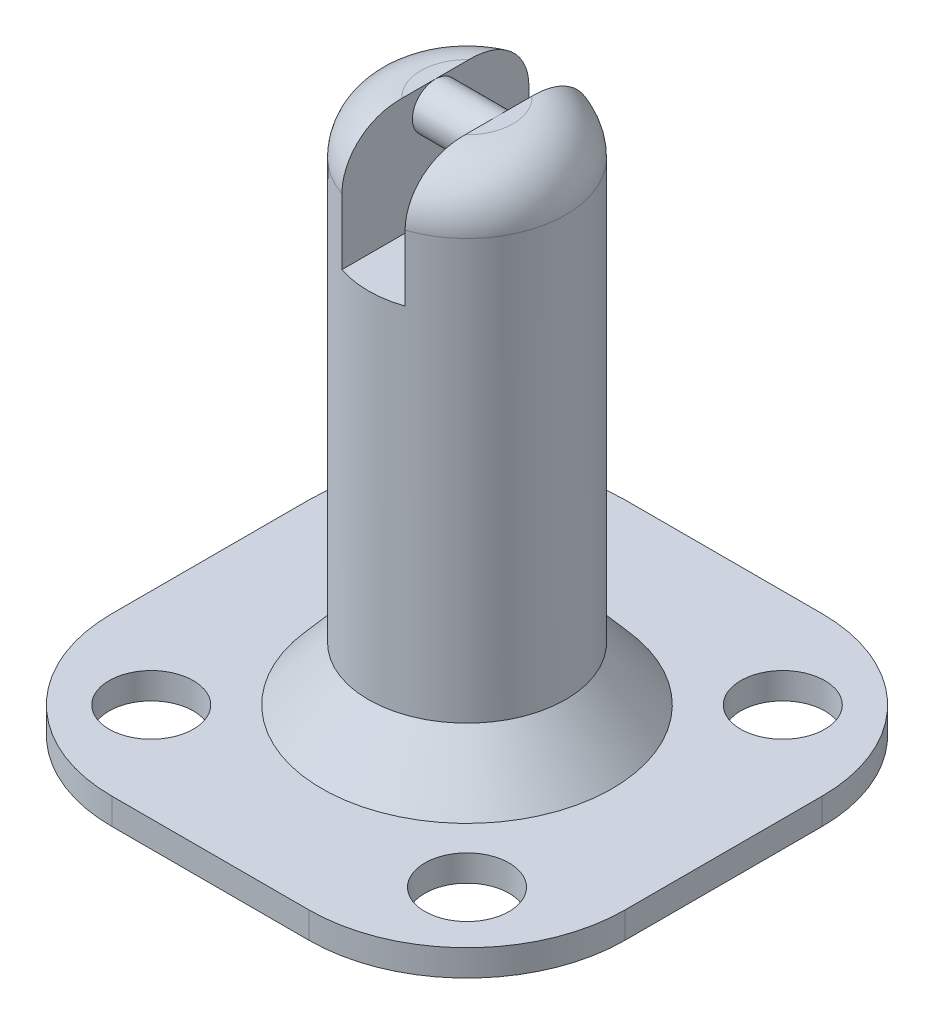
ISO-10303-21;
HEADER;
FILE_DESCRIPTION(('STEP AP214'),'2;1');
FILE_NAME('part.step','',(''),(''),'','','');
FILE_SCHEMA(('AUTOMOTIVE_DESIGN { 1 0 10303 214 1 1 1 1 }'));
ENDSEC;
DATA;
#1=APPLICATION_CONTEXT('core data for automotive mechanical design processes');
#2=APPLICATION_PROTOCOL_DEFINITION('international standard','automotive_design',2000,#1);
#3=PRODUCT_CONTEXT('',#1,'mechanical');
#4=PRODUCT('Part','Part','',(#3));
#5=PRODUCT_RELATED_PRODUCT_CATEGORY('part','',(#4));
#6=PRODUCT_DEFINITION_FORMATION('','',#4);
#7=PRODUCT_DEFINITION_CONTEXT('part definition',#1,'design');
#8=PRODUCT_DEFINITION('design','',#6,#7);
#9=PRODUCT_DEFINITION_SHAPE('','',#8);
#10=(LENGTH_UNIT() NAMED_UNIT(*) SI_UNIT(.MILLI.,.METRE.));
#11=(NAMED_UNIT(*) PLANE_ANGLE_UNIT() SI_UNIT($,.RADIAN.));
#12=(NAMED_UNIT(*) SI_UNIT($,.STERADIAN.) SOLID_ANGLE_UNIT());
#13=UNCERTAINTY_MEASURE_WITH_UNIT(LENGTH_MEASURE(1.E-05),#10,'distance_accuracy_value','');
#14=(GEOMETRIC_REPRESENTATION_CONTEXT(3) GLOBAL_UNCERTAINTY_ASSIGNED_CONTEXT((#13)) GLOBAL_UNIT_ASSIGNED_CONTEXT((#10,
#11,#12)) REPRESENTATION_CONTEXT('',''));
#15=CARTESIAN_POINT('',(0.,0.,0.));
#16=DIRECTION('',(0.,0.,1.));
#17=DIRECTION('',(1.,0.,0.));
#18=AXIS2_PLACEMENT_3D('',#15,#16,#17);
#19=CARTESIAN_POINT('',(0.,20.,0.));
#20=DIRECTION('',(0.,1.,0.));
#21=DIRECTION('',(0.,0.,1.));
#22=AXIS2_PLACEMENT_3D('',#19,#20,#21);
#23=PLANE('',#22);
#24=DIRECTION('',(0.,0.,-1.));
#25=VECTOR('',#24,1.);
#26=CARTESIAN_POINT('',(-1.2,20.,0.));
#27=LINE('',#26,#25);
#28=CARTESIAN_POINT('',(-1.2,20.,1.2737739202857));
#29=VERTEX_POINT('',#28);
#30=CARTESIAN_POINT('',(-1.2,20.,-1.2737739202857));
#31=VERTEX_POINT('',#30);
#32=EDGE_CURVE('E176',#29,#31,#27,.T.);
#33=ORIENTED_EDGE('',*,*,#32,.T.);
#34=CARTESIAN_POINT('',(0.,20.,0.));
#35=DIRECTION('',(0.,1.,0.));
#36=DIRECTION('',(0.,0.,1.));
#37=AXIS2_PLACEMENT_3D('',#34,#35,#36);
#38=CIRCLE('',#37,1.75);
#39=EDGE_CURVE('E147',#31,#29,#38,.T.);
#40=ORIENTED_EDGE('',*,*,#39,.T.);
#41=EDGE_LOOP('',(#33,#40));
#42=FACE_BOUND('',#41,.T.);
#43=ADVANCED_FACE('F33',(#42),#23,.T.);
#44=CARTESIAN_POINT('',(0.,20.,0.));
#45=DIRECTION('',(0.,-1.,0.));
#46=DIRECTION('',(0.,0.,-1.));
#47=AXIS2_PLACEMENT_3D('',#44,#45,#46);
#48=CYLINDRICAL_SURFACE('',#47,3.75);
#49=CARTESIAN_POINT('',(0.,2.04841628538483,0.));
#50=DIRECTION('',(0.,1.,0.));
#51=DIRECTION('',(0.,0.,1.));
#52=AXIS2_PLACEMENT_3D('',#49,#50,#51);
#53=CIRCLE('',#52,3.75);
#54=CARTESIAN_POINT('',(0.,2.04841628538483,3.75));
#55=VERTEX_POINT('',#54);
#56=EDGE_CURVE('E168',#55,#55,#53,.T.);
#57=ORIENTED_EDGE('',*,*,#56,.T.);
#58=EDGE_LOOP('',(#57));
#59=FACE_BOUND('',#58,.T.);
#60=DIRECTION('',(0.,-1.,0.));
#61=VECTOR('',#60,1.);
#62=CARTESIAN_POINT('',(-1.2,20.,3.5528157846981));
#63=LINE('',#62,#61);
#64=CARTESIAN_POINT('',(-1.2,18.,3.5528157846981));
#65=VERTEX_POINT('',#64);
#66=CARTESIAN_POINT('',(-1.2,15.5,3.5528157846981));
#67=VERTEX_POINT('',#66);
#68=EDGE_CURVE('E158',#65,#67,#63,.T.);
#69=ORIENTED_EDGE('',*,*,#68,.F.);
#70=CARTESIAN_POINT('',(0.,18.,0.));
#71=DIRECTION('',(0.,1.,0.));
#72=DIRECTION('',(0.,0.,1.));
#73=AXIS2_PLACEMENT_3D('',#70,#71,#72);
#74=CIRCLE('',#73,3.75);
#75=CARTESIAN_POINT('',(-1.2,18.,-3.5528157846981));
#76=VERTEX_POINT('',#75);
#77=EDGE_CURVE('E254',#65,#76,#74,.F.);
#78=ORIENTED_EDGE('',*,*,#77,.T.);
#79=DIRECTION('',(0.,-1.,0.));
#80=VECTOR('',#79,1.);
#81=CARTESIAN_POINT('',(-1.2,20.,-3.5528157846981));
#82=LINE('',#81,#80);
#83=CARTESIAN_POINT('',(-1.2,15.5,-3.5528157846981));
#84=VERTEX_POINT('',#83);
#85=EDGE_CURVE('E142',#84,#76,#82,.F.);
#86=ORIENTED_EDGE('',*,*,#85,.F.);
#87=CARTESIAN_POINT('',(0.,15.5,0.));
#88=DIRECTION('',(0.,-1.,0.));
#89=DIRECTION('',(0.,0.,-1.));
#90=AXIS2_PLACEMENT_3D('',#87,#88,#89);
#91=CIRCLE('',#90,3.75);
#92=CARTESIAN_POINT('',(1.2,15.5,-3.5528157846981));
#93=VERTEX_POINT('',#92);
#94=EDGE_CURVE('E135',#84,#93,#91,.T.);
#95=ORIENTED_EDGE('',*,*,#94,.T.);
#96=DIRECTION('',(0.,-1.,0.));
#97=VECTOR('',#96,1.);
#98=CARTESIAN_POINT('',(1.2,20.,-3.5528157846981));
#99=LINE('',#98,#97);
#100=CARTESIAN_POINT('',(1.2,18.,-3.5528157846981));
#101=VERTEX_POINT('',#100);
#102=EDGE_CURVE('E139',#93,#101,#99,.F.);
#103=ORIENTED_EDGE('',*,*,#102,.T.);
#104=CARTESIAN_POINT('',(0.,18.,0.));
#105=DIRECTION('',(0.,1.,0.));
#106=DIRECTION('',(0.,0.,1.));
#107=AXIS2_PLACEMENT_3D('',#104,#105,#106);
#108=CIRCLE('',#107,3.75);
#109=CARTESIAN_POINT('',(1.2,18.,3.5528157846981));
#110=VERTEX_POINT('',#109);
#111=EDGE_CURVE('E255',#101,#110,#108,.F.);
#112=ORIENTED_EDGE('',*,*,#111,.T.);
#113=DIRECTION('',(0.,-1.,0.));
#114=VECTOR('',#113,1.);
#115=CARTESIAN_POINT('',(1.2,20.,3.5528157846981));
#116=LINE('',#115,#114);
#117=CARTESIAN_POINT('',(1.2,15.5,3.5528157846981));
#118=VERTEX_POINT('',#117);
#119=EDGE_CURVE('E157',#110,#118,#116,.T.);
#120=ORIENTED_EDGE('',*,*,#119,.T.);
#121=EDGE_CURVE('E148',#118,#67,#91,.T.);
#122=ORIENTED_EDGE('',*,*,#121,.T.);
#123=EDGE_LOOP('',(#69,#78,#86,#95,#103,#112,#120,#122));
#124=FACE_BOUND('',#123,.T.);
#125=ADVANCED_FACE('F138',(#59,#124),#48,.T.);
#126=DIRECTION('',(0.,0.,-1.));
#127=VECTOR('',#126,1.);
#128=CARTESIAN_POINT('',(1.2,20.,0.));
#129=LINE('',#128,#127);
#130=CARTESIAN_POINT('',(1.2,20.,1.2737739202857));
#131=VERTEX_POINT('',#130);
#132=CARTESIAN_POINT('',(1.2,20.,-1.2737739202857));
#133=VERTEX_POINT('',#132);
#134=EDGE_CURVE('E179',#131,#133,#129,.T.);
#135=ORIENTED_EDGE('',*,*,#134,.F.);
#136=CARTESIAN_POINT('',(0.,20.,0.));
#137=DIRECTION('',(0.,1.,0.));
#138=DIRECTION('',(0.,0.,1.));
#139=AXIS2_PLACEMENT_3D('',#136,#137,#138);
#140=CIRCLE('',#139,1.75);
#141=EDGE_CURVE('E256',#131,#133,#140,.T.);
#142=ORIENTED_EDGE('',*,*,#141,.T.);
#143=EDGE_LOOP('',(#135,#142));
#144=FACE_BOUND('',#143,.T.);
#145=ADVANCED_FACE('F234',(#144),#23,.T.);
#146=CARTESIAN_POINT('',(1.2,0.,0.));
#147=DIRECTION('',(1.,0.,0.));
#148=DIRECTION('',(0.,0.,-1.));
#149=AXIS2_PLACEMENT_3D('',#146,#147,#148);
#150=PLANE('',#149);
#151=CARTESIAN_POINT('',(1.2,19.12,0.));
#152=DIRECTION('',(1.,0.,0.));
#153=DIRECTION('',(0.,0.,-1.));
#154=AXIS2_PLACEMENT_3D('',#151,#152,#153);
#155=CIRCLE('',#154,0.875000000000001);
#156=CARTESIAN_POINT('',(1.2,19.12,-0.875000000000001));
#157=VERTEX_POINT('',#156);
#158=EDGE_CURVE('E181',#157,#157,#155,.F.);
#159=ORIENTED_EDGE('',*,*,#158,.F.);
#160=EDGE_LOOP('',(#159));
#161=FACE_BOUND('',#160,.T.);
#162=ORIENTED_EDGE('',*,*,#134,.T.);
#163=CARTESIAN_POINT('',(1.2,20.,-1.2737739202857));
#164=CARTESIAN_POINT('',(1.2,20.0000430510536,-1.34749856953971));
#165=CARTESIAN_POINT('',(1.2,19.9978387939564,-1.42128173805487));
#166=CARTESIAN_POINT('',(1.2,19.9881911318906,-1.56864509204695));
#167=CARTESIAN_POINT('',(1.2,19.9807371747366,-1.64222456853));
#168=CARTESIAN_POINT('',(1.2,19.959785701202,-1.78893589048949));
#169=CARTESIAN_POINT('',(1.2,19.9462572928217,-1.86206348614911));
#170=CARTESIAN_POINT('',(1.2,19.9127167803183,-2.0067464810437));
#171=CARTESIAN_POINT('',(1.2,19.8927100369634,-2.07830312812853));
#172=CARTESIAN_POINT('',(1.2,19.831526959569,-2.26246423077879));
#173=CARTESIAN_POINT('',(1.2,19.7848925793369,-2.37332835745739));
#174=CARTESIAN_POINT('',(1.2,19.6739503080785,-2.58549931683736));
#175=CARTESIAN_POINT('',(1.2,19.6096885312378,-2.68683017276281));
#176=CARTESIAN_POINT('',(1.2,19.464141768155,-2.87723205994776));
#177=CARTESIAN_POINT('',(1.2,19.3827810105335,-2.96624549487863));
#178=CARTESIAN_POINT('',(1.2,19.2052034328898,-3.12819040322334));
#179=CARTESIAN_POINT('',(1.2,19.1089752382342,-3.20110945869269));
#180=CARTESIAN_POINT('',(1.2,18.9116433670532,-3.3236154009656));
#181=CARTESIAN_POINT('',(1.2,18.8113100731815,-3.37444711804));
#182=CARTESIAN_POINT('',(1.2,18.6033679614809,-3.45776034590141));
#183=CARTESIAN_POINT('',(1.2,18.4957686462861,-3.49026532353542));
#184=CARTESIAN_POINT('',(1.2,18.3227167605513,-3.52626989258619));
#185=CARTESIAN_POINT('',(1.2,18.2585386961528,-3.53621771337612));
#186=CARTESIAN_POINT('',(1.2,18.1295846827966,-3.54948893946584));
#187=CARTESIAN_POINT('',(1.2,18.0648096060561,-3.55282082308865));
#188=CARTESIAN_POINT('',(1.2,18.,-3.5528157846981));
#189=B_SPLINE_CURVE_WITH_KNOTS('',3,(#163,#164,#165,#166,#167,#168,#169,#170,#171,#172,#173,
#174,#175,#176,#177,#178,#179,#180,#181,#182,#183,#184,#185,#186,#187,#188),.UNSPECIFIED.,.F.,
.F.,(4,2,2,2,2,2,2,2,2,2,2,2,4),(0.,0.221225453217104,0.442896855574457,0.665708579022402,
0.888336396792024,1.24750116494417,1.6057351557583,1.96559140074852,2.32572433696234,
2.66149094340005,2.99682662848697,3.19135178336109,3.38562749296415),.UNSPECIFIED.);
#190=EDGE_CURVE('E156',#133,#101,#189,.T.);
#191=ORIENTED_EDGE('',*,*,#190,.T.);
#192=ORIENTED_EDGE('',*,*,#102,.F.);
#193=DIRECTION('',(0.,0.,1.));
#194=VECTOR('',#193,1.);
#195=CARTESIAN_POINT('',(1.2,15.5,-3.75));
#196=LINE('',#195,#194);
#197=EDGE_CURVE('E155',#93,#118,#196,.T.);
#198=ORIENTED_EDGE('',*,*,#197,.T.);
#199=ORIENTED_EDGE('',*,*,#119,.F.);
#200=CARTESIAN_POINT('',(1.2,18.,3.5528157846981));
#201=CARTESIAN_POINT('',(1.2,18.053746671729,3.55281611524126));
#202=CARTESIAN_POINT('',(1.2,18.1074672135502,3.5505275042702));
#203=CARTESIAN_POINT('',(1.2,18.2145152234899,3.54140215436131));
#204=CARTESIAN_POINT('',(1.2,18.2678427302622,3.53456586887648));
#205=CARTESIAN_POINT('',(1.2,18.4264589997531,3.5073278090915));
#206=CARTESIAN_POINT('',(1.2,18.5306708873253,3.48019645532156));
#207=CARTESIAN_POINT('',(1.2,18.7330305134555,3.408853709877));
#208=CARTESIAN_POINT('',(1.2,18.8311768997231,3.36463852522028));
#209=CARTESIAN_POINT('',(1.2,19.0188029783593,3.26053979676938));
#210=CARTESIAN_POINT('',(1.2,19.1082806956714,3.20065269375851));
#211=CARTESIAN_POINT('',(1.2,19.2773175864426,3.0662588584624));
#212=CARTESIAN_POINT('',(1.2,19.356737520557,2.99157736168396));
#213=CARTESIAN_POINT('',(1.2,19.502463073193,2.83046505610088));
#214=CARTESIAN_POINT('',(1.2,19.5687749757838,2.74403991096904));
#215=CARTESIAN_POINT('',(1.2,19.6896442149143,2.5581494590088));
#216=CARTESIAN_POINT('',(1.2,19.7435916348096,2.45828916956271));
#217=CARTESIAN_POINT('',(1.2,19.8356250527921,2.25128145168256));
#218=CARTESIAN_POINT('',(1.2,19.8736761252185,2.14411857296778));
#219=CARTESIAN_POINT('',(1.2,19.9211143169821,1.97293297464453));
#220=CARTESIAN_POINT('',(1.2,19.935780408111,1.9103034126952));
#221=CARTESIAN_POINT('',(1.2,19.9603790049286,1.78408240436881));
#222=CARTESIAN_POINT('',(1.2,19.9703091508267,1.72049049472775));
#223=CARTESIAN_POINT('',(1.2,19.9857234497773,1.59310501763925));
#224=CARTESIAN_POINT('',(1.2,19.9912291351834,1.5293139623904));
#225=CARTESIAN_POINT('',(1.2,19.9983771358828,1.40159532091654));
#226=CARTESIAN_POINT('',(1.2,20.0000245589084,1.33766802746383));
#227=CARTESIAN_POINT('',(1.2,20.,1.2737739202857));
#228=B_SPLINE_CURVE_WITH_KNOTS('',3,(#200,#201,#202,#203,#204,#205,#206,#207,#208,#209,#210,
#211,#212,#213,#214,#215,#216,#217,#218,#219,#220,#221,#222,#223,#224,#225,#226,#227),
.UNSPECIFIED.,.F.,.F.,(4,2,2,2,2,2,2,2,2,2,2,2,2,4),(0.,0.161139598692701,0.32226313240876,
0.643653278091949,0.965114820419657,1.28664943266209,1.61223697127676,1.93766804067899,
2.27675313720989,2.61657936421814,2.80939105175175,3.00229871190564,3.19426177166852,
3.38597055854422),.UNSPECIFIED.);
#229=EDGE_CURVE('E220',#110,#131,#228,.T.);
#230=ORIENTED_EDGE('',*,*,#229,.T.);
#231=EDGE_LOOP('',(#162,#191,#192,#198,#199,#230));
#232=FACE_BOUND('',#231,.T.);
#233=ADVANCED_FACE('F153',(#161,#232),#150,.F.);
#234=CARTESIAN_POINT('',(-1.2,0.,0.));
#235=DIRECTION('',(1.,0.,0.));
#236=DIRECTION('',(0.,0.,-1.));
#237=AXIS2_PLACEMENT_3D('',#234,#235,#236);
#238=PLANE('',#237);
#239=CARTESIAN_POINT('',(-1.2,19.12,0.));
#240=DIRECTION('',(1.,0.,0.));
#241=DIRECTION('',(0.,0.,-1.));
#242=AXIS2_PLACEMENT_3D('',#239,#240,#241);
#243=CIRCLE('',#242,0.875000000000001);
#244=CARTESIAN_POINT('',(-1.2,19.12,-0.875000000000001));
#245=VERTEX_POINT('',#244);
#246=EDGE_CURVE('E163',#245,#245,#243,.T.);
#247=ORIENTED_EDGE('',*,*,#246,.F.);
#248=EDGE_LOOP('',(#247));
#249=FACE_BOUND('',#248,.T.);
#250=ORIENTED_EDGE('',*,*,#32,.F.);
#251=CARTESIAN_POINT('',(-1.2,20.,1.2737739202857));
#252=CARTESIAN_POINT('',(-1.2,20.0000430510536,1.34749856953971));
#253=CARTESIAN_POINT('',(-1.2,19.9978387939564,1.42128173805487));
#254=CARTESIAN_POINT('',(-1.2,19.9881911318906,1.56864509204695));
#255=CARTESIAN_POINT('',(-1.2,19.9807371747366,1.64222456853));
#256=CARTESIAN_POINT('',(-1.2,19.959785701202,1.78893589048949));
#257=CARTESIAN_POINT('',(-1.2,19.9462572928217,1.86206348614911));
#258=CARTESIAN_POINT('',(-1.2,19.9127167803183,2.0067464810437));
#259=CARTESIAN_POINT('',(-1.2,19.8927100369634,2.07830312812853));
#260=CARTESIAN_POINT('',(-1.2,19.831526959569,2.26246423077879));
#261=CARTESIAN_POINT('',(-1.2,19.7848925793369,2.37332835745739));
#262=CARTESIAN_POINT('',(-1.2,19.6739503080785,2.58549931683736));
#263=CARTESIAN_POINT('',(-1.2,19.6096885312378,2.68683017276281));
#264=CARTESIAN_POINT('',(-1.2,19.464141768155,2.87723205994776));
#265=CARTESIAN_POINT('',(-1.2,19.3827810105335,2.96624549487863));
#266=CARTESIAN_POINT('',(-1.2,19.2052034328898,3.12819040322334));
#267=CARTESIAN_POINT('',(-1.2,19.1089752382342,3.20110945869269));
#268=CARTESIAN_POINT('',(-1.2,18.9116433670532,3.3236154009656));
#269=CARTESIAN_POINT('',(-1.2,18.8113100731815,3.37444711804));
#270=CARTESIAN_POINT('',(-1.2,18.6033679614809,3.45776034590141));
#271=CARTESIAN_POINT('',(-1.2,18.4957686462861,3.49026532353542));
#272=CARTESIAN_POINT('',(-1.2,18.3227167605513,3.52626989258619));
#273=CARTESIAN_POINT('',(-1.2,18.2585386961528,3.53621771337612));
#274=CARTESIAN_POINT('',(-1.2,18.1295846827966,3.54948893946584));
#275=CARTESIAN_POINT('',(-1.2,18.0648096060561,3.55282082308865));
#276=CARTESIAN_POINT('',(-1.2,18.,3.5528157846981));
#277=B_SPLINE_CURVE_WITH_KNOTS('',3,(#251,#252,#253,#254,#255,#256,#257,#258,#259,#260,#261,
#262,#263,#264,#265,#266,#267,#268,#269,#270,#271,#272,#273,#274,#275,#276),.UNSPECIFIED.,.F.,
.F.,(4,2,2,2,2,2,2,2,2,2,2,2,4),(0.,0.221225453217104,0.442896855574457,0.665708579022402,
0.888336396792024,1.24750116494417,1.6057351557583,1.96559140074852,2.32572433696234,
2.66149094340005,2.99682662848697,3.19135178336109,3.38562749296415),.UNSPECIFIED.);
#278=EDGE_CURVE('E193',#29,#65,#277,.T.);
#279=ORIENTED_EDGE('',*,*,#278,.T.);
#280=ORIENTED_EDGE('',*,*,#68,.T.);
#281=DIRECTION('',(0.,0.,1.));
#282=VECTOR('',#281,1.);
#283=CARTESIAN_POINT('',(-1.2,15.5,-3.75));
#284=LINE('',#283,#282);
#285=EDGE_CURVE('E164',#84,#67,#284,.T.);
#286=ORIENTED_EDGE('',*,*,#285,.F.);
#287=ORIENTED_EDGE('',*,*,#85,.T.);
#288=CARTESIAN_POINT('',(-1.2,18.,-3.5528157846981));
#289=CARTESIAN_POINT('',(-1.2,18.053746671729,-3.55281611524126));
#290=CARTESIAN_POINT('',(-1.2,18.1074672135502,-3.5505275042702));
#291=CARTESIAN_POINT('',(-1.2,18.2145152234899,-3.54140215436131));
#292=CARTESIAN_POINT('',(-1.2,18.2678427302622,-3.53456586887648));
#293=CARTESIAN_POINT('',(-1.2,18.4264589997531,-3.5073278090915));
#294=CARTESIAN_POINT('',(-1.2,18.5306708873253,-3.48019645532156));
#295=CARTESIAN_POINT('',(-1.2,18.7330305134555,-3.408853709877));
#296=CARTESIAN_POINT('',(-1.2,18.8311768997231,-3.36463852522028));
#297=CARTESIAN_POINT('',(-1.2,19.0188029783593,-3.26053979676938));
#298=CARTESIAN_POINT('',(-1.2,19.1082806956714,-3.20065269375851));
#299=CARTESIAN_POINT('',(-1.2,19.2773175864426,-3.0662588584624));
#300=CARTESIAN_POINT('',(-1.2,19.356737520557,-2.99157736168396));
#301=CARTESIAN_POINT('',(-1.2,19.502463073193,-2.83046505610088));
#302=CARTESIAN_POINT('',(-1.2,19.5687749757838,-2.74403991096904));
#303=CARTESIAN_POINT('',(-1.2,19.6896442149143,-2.5581494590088));
#304=CARTESIAN_POINT('',(-1.2,19.7435916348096,-2.45828916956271));
#305=CARTESIAN_POINT('',(-1.2,19.8356250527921,-2.25128145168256));
#306=CARTESIAN_POINT('',(-1.2,19.8736761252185,-2.14411857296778));
#307=CARTESIAN_POINT('',(-1.2,19.9211143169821,-1.97293297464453));
#308=CARTESIAN_POINT('',(-1.2,19.935780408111,-1.9103034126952));
#309=CARTESIAN_POINT('',(-1.2,19.9603790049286,-1.78408240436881));
#310=CARTESIAN_POINT('',(-1.2,19.9703091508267,-1.72049049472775));
#311=CARTESIAN_POINT('',(-1.2,19.9857234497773,-1.59310501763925));
#312=CARTESIAN_POINT('',(-1.2,19.9912291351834,-1.5293139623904));
#313=CARTESIAN_POINT('',(-1.2,19.9983771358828,-1.40159532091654));
#314=CARTESIAN_POINT('',(-1.2,20.0000245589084,-1.33766802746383));
#315=CARTESIAN_POINT('',(-1.2,20.,-1.2737739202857));
#316=B_SPLINE_CURVE_WITH_KNOTS('',3,(#288,#289,#290,#291,#292,#293,#294,#295,#296,#297,#298,
#299,#300,#301,#302,#303,#304,#305,#306,#307,#308,#309,#310,#311,#312,#313,#314,#315),
.UNSPECIFIED.,.F.,.F.,(4,2,2,2,2,2,2,2,2,2,2,2,2,4),(0.,0.161139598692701,0.32226313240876,
0.643653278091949,0.965114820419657,1.28664943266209,1.61223697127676,1.93766804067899,
2.27675313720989,2.61657936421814,2.80939105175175,3.00229871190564,3.19426177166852,
3.38597055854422),.UNSPECIFIED.);
#317=EDGE_CURVE('E186',#76,#31,#316,.T.);
#318=ORIENTED_EDGE('',*,*,#317,.T.);
#319=EDGE_LOOP('',(#250,#279,#280,#286,#287,#318));
#320=FACE_BOUND('',#319,.T.);
#321=ADVANCED_FACE('F198',(#249,#320),#238,.T.);
#322=CARTESIAN_POINT('',(1.2,19.12,0.));
#323=DIRECTION('',(-1.,0.,0.));
#324=DIRECTION('',(0.,0.,1.));
#325=AXIS2_PLACEMENT_3D('',#322,#323,#324);
#326=CYLINDRICAL_SURFACE('',#325,0.875000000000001);
#327=ORIENTED_EDGE('',*,*,#158,.T.);
#328=EDGE_LOOP('',(#327));
#329=FACE_BOUND('',#328,.T.);
#330=ORIENTED_EDGE('',*,*,#246,.T.);
#331=EDGE_LOOP('',(#330));
#332=FACE_BOUND('',#331,.T.);
#333=ADVANCED_FACE('F262',(#329,#332),#326,.T.);
#334=CARTESIAN_POINT('',(-1.2,15.5,-3.75));
#335=DIRECTION('',(0.,-1.,0.));
#336=DIRECTION('',(0.,0.,-1.));
#337=AXIS2_PLACEMENT_3D('',#334,#335,#336);
#338=PLANE('',#337);
#339=ORIENTED_EDGE('',*,*,#197,.F.);
#340=ORIENTED_EDGE('',*,*,#94,.F.);
#341=ORIENTED_EDGE('',*,*,#285,.T.);
#342=ORIENTED_EDGE('',*,*,#121,.F.);
#343=EDGE_LOOP('',(#339,#340,#341,#342));
#344=FACE_BOUND('',#343,.T.);
#345=ADVANCED_FACE('F161',(#344),#338,.F.);
#346=CARTESIAN_POINT('',(0.,18.,0.));
#347=DIRECTION('',(0.,1.,0.));
#348=DIRECTION('',(0.,0.,1.));
#349=AXIS2_PLACEMENT_3D('',#346,#347,#348);
#350=DEGENERATE_TOROIDAL_SURFACE('',#349,1.75,2.,.T.);
#351=ORIENTED_EDGE('',*,*,#317,.F.);
#352=ORIENTED_EDGE('',*,*,#77,.F.);
#353=ORIENTED_EDGE('',*,*,#278,.F.);
#354=ORIENTED_EDGE('',*,*,#39,.F.);
#355=EDGE_LOOP('',(#351,#352,#353,#354));
#356=FACE_BOUND('',#355,.T.);
#357=ADVANCED_FACE('F202',(#356),#350,.T.);
#358=CARTESIAN_POINT('',(0.,18.,0.));
#359=DIRECTION('',(0.,1.,0.));
#360=DIRECTION('',(0.,0.,1.));
#361=AXIS2_PLACEMENT_3D('',#358,#359,#360);
#362=DEGENERATE_TOROIDAL_SURFACE('',#361,1.75,2.,.T.);
#363=ORIENTED_EDGE('',*,*,#229,.F.);
#364=ORIENTED_EDGE('',*,*,#111,.F.);
#365=ORIENTED_EDGE('',*,*,#190,.F.);
#366=ORIENTED_EDGE('',*,*,#141,.F.);
#367=EDGE_LOOP('',(#363,#364,#365,#366));
#368=FACE_BOUND('',#367,.T.);
#369=ADVANCED_FACE('F207',(#368),#362,.T.);
#370=CARTESIAN_POINT('',(0.,2.04841628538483,0.));
#371=DIRECTION('',(0.,-1.,0.));
#372=DIRECTION('',(0.,0.,-1.));
#373=AXIS2_PLACEMENT_3D('',#370,#371,#372);
#374=CONICAL_SURFACE('',#373,3.75,0.71175959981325);
#375=CARTESIAN_POINT('',(0.,0.,0.));
#376=DIRECTION('',(0.,-1.,0.));
#377=DIRECTION('',(0.,0.,-1.));
#378=AXIS2_PLACEMENT_3D('',#375,#376,#377);
#379=CIRCLE('',#378,5.51694929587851);
#380=CARTESIAN_POINT('',(0.,0.,-5.51694929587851));
#381=VERTEX_POINT('',#380);
#382=EDGE_CURVE('E358',#381,#381,#379,.F.);
#383=ORIENTED_EDGE('',*,*,#382,.T.);
#384=EDGE_LOOP('',(#383));
#385=FACE_BOUND('',#384,.T.);
#386=ORIENTED_EDGE('',*,*,#56,.F.);
#387=EDGE_LOOP('',(#386));
#388=FACE_BOUND('',#387,.T.);
#389=ADVANCED_FACE('F214',(#385,#388),#374,.T.);
#390=CARTESIAN_POINT('',(-9.75,-1.,9.75));
#391=DIRECTION('',(1.,0.,0.));
#392=DIRECTION('',(0.,0.,-1.));
#393=AXIS2_PLACEMENT_3D('',#390,#391,#392);
#394=PLANE('',#393);
#395=DIRECTION('',(0.,0.,-1.));
#396=VECTOR('',#395,1.);
#397=CARTESIAN_POINT('',(-9.75,0.,9.75));
#398=LINE('',#397,#396);
#399=CARTESIAN_POINT('',(-9.75,0.,3.75));
#400=VERTEX_POINT('',#399);
#401=CARTESIAN_POINT('',(-9.75,0.,-3.75));
#402=VERTEX_POINT('',#401);
#403=EDGE_CURVE('E346',#400,#402,#398,.T.);
#404=ORIENTED_EDGE('',*,*,#403,.T.);
#405=DIRECTION('',(0.,1.,0.));
#406=VECTOR('',#405,1.);
#407=CARTESIAN_POINT('',(-9.75,-1.,-3.75));
#408=LINE('',#407,#406);
#409=CARTESIAN_POINT('',(-9.75,-1.,-3.75));
#410=VERTEX_POINT('',#409);
#411=EDGE_CURVE('E409',#402,#410,#408,.F.);
#412=ORIENTED_EDGE('',*,*,#411,.T.);
#413=DIRECTION('',(0.,0.,-1.));
#414=VECTOR('',#413,1.);
#415=CARTESIAN_POINT('',(-9.75,-1.,9.75));
#416=LINE('',#415,#414);
#417=CARTESIAN_POINT('',(-9.75,-1.,3.75));
#418=VERTEX_POINT('',#417);
#419=EDGE_CURVE('E347',#418,#410,#416,.T.);
#420=ORIENTED_EDGE('',*,*,#419,.F.);
#421=DIRECTION('',(0.,1.,0.));
#422=VECTOR('',#421,1.);
#423=CARTESIAN_POINT('',(-9.75,-1.,3.75));
#424=LINE('',#423,#422);
#425=EDGE_CURVE('E406',#418,#400,#424,.T.);
#426=ORIENTED_EDGE('',*,*,#425,.T.);
#427=EDGE_LOOP('',(#404,#412,#420,#426));
#428=FACE_BOUND('',#427,.T.);
#429=ADVANCED_FACE('F277',(#428),#394,.F.);
#430=CARTESIAN_POINT('',(-9.75,-1.,-9.75));
#431=DIRECTION('',(0.,0.,1.));
#432=DIRECTION('',(1.,0.,0.));
#433=AXIS2_PLACEMENT_3D('',#430,#431,#432);
#434=PLANE('',#433);
#435=DIRECTION('',(1.,0.,0.));
#436=VECTOR('',#435,1.);
#437=CARTESIAN_POINT('',(-9.75,0.,-9.75));
#438=LINE('',#437,#436);
#439=CARTESIAN_POINT('',(-3.75,0.,-9.75));
#440=VERTEX_POINT('',#439);
#441=CARTESIAN_POINT('',(3.75,0.,-9.75));
#442=VERTEX_POINT('',#441);
#443=EDGE_CURVE('E361',#440,#442,#438,.T.);
#444=ORIENTED_EDGE('',*,*,#443,.T.);
#445=DIRECTION('',(0.,1.,0.));
#446=VECTOR('',#445,1.);
#447=CARTESIAN_POINT('',(3.75,-1.,-9.75));
#448=LINE('',#447,#446);
#449=CARTESIAN_POINT('',(3.75,-1.,-9.75));
#450=VERTEX_POINT('',#449);
#451=EDGE_CURVE('E397',#442,#450,#448,.F.);
#452=ORIENTED_EDGE('',*,*,#451,.T.);
#453=DIRECTION('',(1.,0.,0.));
#454=VECTOR('',#453,1.);
#455=CARTESIAN_POINT('',(-9.75,-1.,-9.75));
#456=LINE('',#455,#454);
#457=CARTESIAN_POINT('',(-3.75,-1.,-9.75));
#458=VERTEX_POINT('',#457);
#459=EDGE_CURVE('E350',#458,#450,#456,.T.);
#460=ORIENTED_EDGE('',*,*,#459,.F.);
#461=DIRECTION('',(0.,1.,0.));
#462=VECTOR('',#461,1.);
#463=CARTESIAN_POINT('',(-3.75,-1.,-9.75));
#464=LINE('',#463,#462);
#465=EDGE_CURVE('E394',#458,#440,#464,.T.);
#466=ORIENTED_EDGE('',*,*,#465,.T.);
#467=EDGE_LOOP('',(#444,#452,#460,#466));
#468=FACE_BOUND('',#467,.T.);
#469=ADVANCED_FACE('F281',(#468),#434,.F.);
#470=CARTESIAN_POINT('',(9.75,-1.,9.75));
#471=DIRECTION('',(-1.,0.,0.));
#472=DIRECTION('',(0.,0.,1.));
#473=AXIS2_PLACEMENT_3D('',#470,#471,#472);
#474=PLANE('',#473);
#475=DIRECTION('',(0.,0.,1.));
#476=VECTOR('',#475,1.);
#477=CARTESIAN_POINT('',(9.75,-1.,9.75));
#478=LINE('',#477,#476);
#479=CARTESIAN_POINT('',(9.75,-1.,-3.75));
#480=VERTEX_POINT('',#479);
#481=CARTESIAN_POINT('',(9.75,-1.,3.75));
#482=VERTEX_POINT('',#481);
#483=EDGE_CURVE('E354',#480,#482,#478,.T.);
#484=ORIENTED_EDGE('',*,*,#483,.F.);
#485=DIRECTION('',(0.,1.,0.));
#486=VECTOR('',#485,1.);
#487=CARTESIAN_POINT('',(9.75,-1.,-3.75));
#488=LINE('',#487,#486);
#489=CARTESIAN_POINT('',(9.75,0.,-3.75));
#490=VERTEX_POINT('',#489);
#491=EDGE_CURVE('E383',#480,#490,#488,.T.);
#492=ORIENTED_EDGE('',*,*,#491,.T.);
#493=DIRECTION('',(0.,0.,1.));
#494=VECTOR('',#493,1.);
#495=CARTESIAN_POINT('',(9.75,0.,9.75));
#496=LINE('',#495,#494);
#497=CARTESIAN_POINT('',(9.75,0.,3.75));
#498=VERTEX_POINT('',#497);
#499=EDGE_CURVE('E364',#490,#498,#496,.T.);
#500=ORIENTED_EDGE('',*,*,#499,.T.);
#501=DIRECTION('',(0.,1.,0.));
#502=VECTOR('',#501,1.);
#503=CARTESIAN_POINT('',(9.75,-1.,3.75));
#504=LINE('',#503,#502);
#505=EDGE_CURVE('E230',#498,#482,#504,.F.);
#506=ORIENTED_EDGE('',*,*,#505,.T.);
#507=EDGE_LOOP('',(#484,#492,#500,#506));
#508=FACE_BOUND('',#507,.T.);
#509=ADVANCED_FACE('F285',(#508),#474,.F.);
#510=CARTESIAN_POINT('',(-9.75,-1.,9.75));
#511=DIRECTION('',(0.,0.,-1.));
#512=DIRECTION('',(-1.,0.,0.));
#513=AXIS2_PLACEMENT_3D('',#510,#511,#512);
#514=PLANE('',#513);
#515=DIRECTION('',(-1.,0.,0.));
#516=VECTOR('',#515,1.);
#517=CARTESIAN_POINT('',(-9.75,-1.,9.75));
#518=LINE('',#517,#516);
#519=CARTESIAN_POINT('',(3.75,-1.,9.75));
#520=VERTEX_POINT('',#519);
#521=CARTESIAN_POINT('',(-3.75,-1.,9.75));
#522=VERTEX_POINT('',#521);
#523=EDGE_CURVE('E356',#520,#522,#518,.T.);
#524=ORIENTED_EDGE('',*,*,#523,.F.);
#525=DIRECTION('',(0.,1.,0.));
#526=VECTOR('',#525,1.);
#527=CARTESIAN_POINT('',(3.75,-1.,9.75));
#528=LINE('',#527,#526);
#529=CARTESIAN_POINT('',(3.75,0.,9.75));
#530=VERTEX_POINT('',#529);
#531=EDGE_CURVE('E11',#520,#530,#528,.T.);
#532=ORIENTED_EDGE('',*,*,#531,.T.);
#533=DIRECTION('',(-1.,0.,0.));
#534=VECTOR('',#533,1.);
#535=CARTESIAN_POINT('',(-9.75,0.,9.75));
#536=LINE('',#535,#534);
#537=CARTESIAN_POINT('',(-3.75,0.,9.75));
#538=VERTEX_POINT('',#537);
#539=EDGE_CURVE('E351',#530,#538,#536,.T.);
#540=ORIENTED_EDGE('',*,*,#539,.T.);
#541=DIRECTION('',(0.,1.,0.));
#542=VECTOR('',#541,1.);
#543=CARTESIAN_POINT('',(-3.75,-1.,9.75));
#544=LINE('',#543,#542);
#545=EDGE_CURVE('E41',#538,#522,#544,.F.);
#546=ORIENTED_EDGE('',*,*,#545,.T.);
#547=EDGE_LOOP('',(#524,#532,#540,#546));
#548=FACE_BOUND('',#547,.T.);
#549=ADVANCED_FACE('F289',(#548),#514,.F.);
#550=CARTESIAN_POINT('',(0.,-1.,0.));
#551=DIRECTION('',(0.,-1.,0.));
#552=DIRECTION('',(0.,0.,-1.));
#553=AXIS2_PLACEMENT_3D('',#550,#551,#552);
#554=PLANE('',#553);
#555=CARTESIAN_POINT('',(6.,-1.,-6.));
#556=DIRECTION('',(0.,-1.,0.));
#557=DIRECTION('',(0.,0.,-1.));
#558=AXIS2_PLACEMENT_3D('',#555,#556,#557);
#559=CIRCLE('',#558,1.6);
#560=CARTESIAN_POINT('',(6.,-1.,-7.6));
#561=VERTEX_POINT('',#560);
#562=EDGE_CURVE('E321',#561,#561,#559,.T.);
#563=ORIENTED_EDGE('',*,*,#562,.F.);
#564=EDGE_LOOP('',(#563));
#565=FACE_BOUND('',#564,.T.);
#566=CARTESIAN_POINT('',(6.,-1.,6.));
#567=DIRECTION('',(0.,-1.,0.));
#568=DIRECTION('',(0.,0.,-1.));
#569=AXIS2_PLACEMENT_3D('',#566,#567,#568);
#570=CIRCLE('',#569,1.6);
#571=CARTESIAN_POINT('',(6.,-1.,4.4));
#572=VERTEX_POINT('',#571);
#573=EDGE_CURVE('E329',#572,#572,#570,.T.);
#574=ORIENTED_EDGE('',*,*,#573,.F.);
#575=EDGE_LOOP('',(#574));
#576=FACE_BOUND('',#575,.T.);
#577=CARTESIAN_POINT('',(-6.,-1.,6.));
#578=DIRECTION('',(0.,-1.,0.));
#579=DIRECTION('',(0.,0.,-1.));
#580=AXIS2_PLACEMENT_3D('',#577,#578,#579);
#581=CIRCLE('',#580,1.6);
#582=CARTESIAN_POINT('',(-6.,-1.,4.4));
#583=VERTEX_POINT('',#582);
#584=EDGE_CURVE('E325',#583,#583,#581,.T.);
#585=ORIENTED_EDGE('',*,*,#584,.F.);
#586=EDGE_LOOP('',(#585));
#587=FACE_BOUND('',#586,.T.);
#588=CARTESIAN_POINT('',(-6.,-1.,-6.));
#589=DIRECTION('',(0.,-1.,0.));
#590=DIRECTION('',(0.,0.,-1.));
#591=AXIS2_PLACEMENT_3D('',#588,#589,#590);
#592=CIRCLE('',#591,1.6);
#593=CARTESIAN_POINT('',(-6.,-1.,-7.6));
#594=VERTEX_POINT('',#593);
#595=EDGE_CURVE('E343',#594,#594,#592,.T.);
#596=ORIENTED_EDGE('',*,*,#595,.F.);
#597=EDGE_LOOP('',(#596));
#598=FACE_BOUND('',#597,.T.);
#599=ORIENTED_EDGE('',*,*,#459,.T.);
#600=CARTESIAN_POINT('',(3.75,-1.,-3.75));
#601=DIRECTION('',(0.,-1.,0.));
#602=DIRECTION('',(0.,0.,-1.));
#603=AXIS2_PLACEMENT_3D('',#600,#601,#602);
#604=CIRCLE('',#603,6.);
#605=EDGE_CURVE('E404',#450,#480,#604,.T.);
#606=ORIENTED_EDGE('',*,*,#605,.T.);
#607=ORIENTED_EDGE('',*,*,#483,.T.);
#608=CARTESIAN_POINT('',(3.75,-1.,3.75));
#609=DIRECTION('',(0.,-1.,0.));
#610=DIRECTION('',(0.,0.,-1.));
#611=AXIS2_PLACEMENT_3D('',#608,#609,#610);
#612=CIRCLE('',#611,6.);
#613=EDGE_CURVE('E54',#482,#520,#612,.T.);
#614=ORIENTED_EDGE('',*,*,#613,.T.);
#615=ORIENTED_EDGE('',*,*,#523,.T.);
#616=CARTESIAN_POINT('',(-3.75,-1.,3.75));
#617=DIRECTION('',(0.,-1.,0.));
#618=DIRECTION('',(0.,0.,-1.));
#619=AXIS2_PLACEMENT_3D('',#616,#617,#618);
#620=CIRCLE('',#619,6.);
#621=EDGE_CURVE('E399',#522,#418,#620,.T.);
#622=ORIENTED_EDGE('',*,*,#621,.T.);
#623=ORIENTED_EDGE('',*,*,#419,.T.);
#624=CARTESIAN_POINT('',(-3.75,-1.,-3.75));
#625=DIRECTION('',(0.,-1.,0.));
#626=DIRECTION('',(0.,0.,-1.));
#627=AXIS2_PLACEMENT_3D('',#624,#625,#626);
#628=CIRCLE('',#627,6.);
#629=EDGE_CURVE('E402',#410,#458,#628,.T.);
#630=ORIENTED_EDGE('',*,*,#629,.T.);
#631=EDGE_LOOP('',(#599,#606,#607,#614,#615,#622,#623,#630));
#632=FACE_BOUND('',#631,.T.);
#633=ADVANCED_FACE('F293',(#565,#576,#587,#598,#632),#554,.T.);
#634=CARTESIAN_POINT('',(0.,0.,0.));
#635=DIRECTION('',(0.,-1.,0.));
#636=DIRECTION('',(0.,0.,-1.));
#637=AXIS2_PLACEMENT_3D('',#634,#635,#636);
#638=PLANE('',#637);
#639=CARTESIAN_POINT('',(6.,0.,-6.));
#640=DIRECTION('',(0.,1.,0.));
#641=DIRECTION('',(0.,0.,1.));
#642=AXIS2_PLACEMENT_3D('',#639,#640,#641);
#643=CIRCLE('',#642,1.6);
#644=CARTESIAN_POINT('',(6.,0.,-4.4));
#645=VERTEX_POINT('',#644);
#646=EDGE_CURVE('E324',#645,#645,#643,.T.);
#647=ORIENTED_EDGE('',*,*,#646,.F.);
#648=EDGE_LOOP('',(#647));
#649=FACE_BOUND('',#648,.T.);
#650=CARTESIAN_POINT('',(6.,0.,6.));
#651=DIRECTION('',(0.,1.,0.));
#652=DIRECTION('',(0.,0.,1.));
#653=AXIS2_PLACEMENT_3D('',#650,#651,#652);
#654=CIRCLE('',#653,1.6);
#655=CARTESIAN_POINT('',(6.,0.,7.6));
#656=VERTEX_POINT('',#655);
#657=EDGE_CURVE('E326',#656,#656,#654,.T.);
#658=ORIENTED_EDGE('',*,*,#657,.F.);
#659=EDGE_LOOP('',(#658));
#660=FACE_BOUND('',#659,.T.);
#661=CARTESIAN_POINT('',(-6.,0.,6.));
#662=DIRECTION('',(0.,1.,0.));
#663=DIRECTION('',(0.,0.,1.));
#664=AXIS2_PLACEMENT_3D('',#661,#662,#663);
#665=CIRCLE('',#664,1.6);
#666=CARTESIAN_POINT('',(-6.,0.,7.6));
#667=VERTEX_POINT('',#666);
#668=EDGE_CURVE('E332',#667,#667,#665,.T.);
#669=ORIENTED_EDGE('',*,*,#668,.F.);
#670=EDGE_LOOP('',(#669));
#671=FACE_BOUND('',#670,.T.);
#672=CARTESIAN_POINT('',(-6.,0.,-6.));
#673=DIRECTION('',(0.,1.,0.));
#674=DIRECTION('',(0.,0.,1.));
#675=AXIS2_PLACEMENT_3D('',#672,#673,#674);
#676=CIRCLE('',#675,1.6);
#677=CARTESIAN_POINT('',(-6.,0.,-4.4));
#678=VERTEX_POINT('',#677);
#679=EDGE_CURVE('E340',#678,#678,#676,.T.);
#680=ORIENTED_EDGE('',*,*,#679,.F.);
#681=EDGE_LOOP('',(#680));
#682=FACE_BOUND('',#681,.T.);
#683=ORIENTED_EDGE('',*,*,#382,.F.);
#684=EDGE_LOOP('',(#683));
#685=FACE_BOUND('',#684,.T.);
#686=ORIENTED_EDGE('',*,*,#499,.F.);
#687=CARTESIAN_POINT('',(3.75,0.,-3.75));
#688=DIRECTION('',(0.,-1.,0.));
#689=DIRECTION('',(0.,0.,-1.));
#690=AXIS2_PLACEMENT_3D('',#687,#688,#689);
#691=CIRCLE('',#690,6.);
#692=EDGE_CURVE('E376',#490,#442,#691,.F.);
#693=ORIENTED_EDGE('',*,*,#692,.T.);
#694=ORIENTED_EDGE('',*,*,#443,.F.);
#695=CARTESIAN_POINT('',(-3.75,0.,-3.75));
#696=DIRECTION('',(0.,-1.,0.));
#697=DIRECTION('',(0.,0.,-1.));
#698=AXIS2_PLACEMENT_3D('',#695,#696,#697);
#699=CIRCLE('',#698,6.);
#700=EDGE_CURVE('E391',#440,#402,#699,.F.);
#701=ORIENTED_EDGE('',*,*,#700,.T.);
#702=ORIENTED_EDGE('',*,*,#403,.F.);
#703=CARTESIAN_POINT('',(-3.75,0.,3.75));
#704=DIRECTION('',(0.,-1.,0.));
#705=DIRECTION('',(0.,0.,-1.));
#706=AXIS2_PLACEMENT_3D('',#703,#704,#705);
#707=CIRCLE('',#706,6.);
#708=EDGE_CURVE('E387',#400,#538,#707,.F.);
#709=ORIENTED_EDGE('',*,*,#708,.T.);
#710=ORIENTED_EDGE('',*,*,#539,.F.);
#711=CARTESIAN_POINT('',(3.75,0.,3.75));
#712=DIRECTION('',(0.,-1.,0.));
#713=DIRECTION('',(0.,0.,-1.));
#714=AXIS2_PLACEMENT_3D('',#711,#712,#713);
#715=CIRCLE('',#714,6.);
#716=EDGE_CURVE('E378',#530,#498,#715,.F.);
#717=ORIENTED_EDGE('',*,*,#716,.T.);
#718=EDGE_LOOP('',(#686,#693,#694,#701,#702,#709,#710,#717));
#719=FACE_BOUND('',#718,.T.);
#720=ADVANCED_FACE('F294',(#649,#660,#671,#682,#685,#719),#638,.F.);
#721=CARTESIAN_POINT('',(3.75,-1.,-3.75));
#722=DIRECTION('',(0.,1.,0.));
#723=DIRECTION('',(0.,0.,1.));
#724=AXIS2_PLACEMENT_3D('',#721,#722,#723);
#725=CYLINDRICAL_SURFACE('',#724,6.);
#726=ORIENTED_EDGE('',*,*,#605,.F.);
#727=ORIENTED_EDGE('',*,*,#451,.F.);
#728=ORIENTED_EDGE('',*,*,#692,.F.);
#729=ORIENTED_EDGE('',*,*,#491,.F.);
#730=EDGE_LOOP('',(#726,#727,#728,#729));
#731=FACE_BOUND('',#730,.T.);
#732=ADVANCED_FACE('F216',(#731),#725,.T.);
#733=CARTESIAN_POINT('',(-3.75,-1.,-3.75));
#734=DIRECTION('',(0.,1.,0.));
#735=DIRECTION('',(0.,0.,1.));
#736=AXIS2_PLACEMENT_3D('',#733,#734,#735);
#737=CYLINDRICAL_SURFACE('',#736,6.);
#738=ORIENTED_EDGE('',*,*,#629,.F.);
#739=ORIENTED_EDGE('',*,*,#411,.F.);
#740=ORIENTED_EDGE('',*,*,#700,.F.);
#741=ORIENTED_EDGE('',*,*,#465,.F.);
#742=EDGE_LOOP('',(#738,#739,#740,#741));
#743=FACE_BOUND('',#742,.T.);
#744=ADVANCED_FACE('F419',(#743),#737,.T.);
#745=CARTESIAN_POINT('',(3.75,-1.,3.75));
#746=DIRECTION('',(0.,1.,0.));
#747=DIRECTION('',(0.,0.,1.));
#748=AXIS2_PLACEMENT_3D('',#745,#746,#747);
#749=CYLINDRICAL_SURFACE('',#748,6.);
#750=ORIENTED_EDGE('',*,*,#613,.F.);
#751=ORIENTED_EDGE('',*,*,#505,.F.);
#752=ORIENTED_EDGE('',*,*,#716,.F.);
#753=ORIENTED_EDGE('',*,*,#531,.F.);
#754=EDGE_LOOP('',(#750,#751,#752,#753));
#755=FACE_BOUND('',#754,.T.);
#756=ADVANCED_FACE('F385',(#755),#749,.T.);
#757=CARTESIAN_POINT('',(-3.75,-1.,3.75));
#758=DIRECTION('',(0.,1.,0.));
#759=DIRECTION('',(0.,0.,1.));
#760=AXIS2_PLACEMENT_3D('',#757,#758,#759);
#761=CYLINDRICAL_SURFACE('',#760,6.);
#762=ORIENTED_EDGE('',*,*,#621,.F.);
#763=ORIENTED_EDGE('',*,*,#545,.F.);
#764=ORIENTED_EDGE('',*,*,#708,.F.);
#765=ORIENTED_EDGE('',*,*,#425,.F.);
#766=EDGE_LOOP('',(#762,#763,#764,#765));
#767=FACE_BOUND('',#766,.T.);
#768=ADVANCED_FACE('F35',(#767),#761,.T.);
#769=CARTESIAN_POINT('',(-6.,-2.,-6.));
#770=DIRECTION('',(0.,1.,0.));
#771=DIRECTION('',(0.,0.,1.));
#772=AXIS2_PLACEMENT_3D('',#769,#770,#771);
#773=CYLINDRICAL_SURFACE('',#772,1.6);
#774=ORIENTED_EDGE('',*,*,#595,.T.);
#775=EDGE_LOOP('',(#774));
#776=FACE_BOUND('',#775,.T.);
#777=ORIENTED_EDGE('',*,*,#679,.T.);
#778=EDGE_LOOP('',(#777));
#779=FACE_BOUND('',#778,.T.);
#780=ADVANCED_FACE('F301',(#776,#779),#773,.F.);
#781=CARTESIAN_POINT('',(-6.,-2.,6.));
#782=DIRECTION('',(0.,1.,0.));
#783=DIRECTION('',(0.,0.,1.));
#784=AXIS2_PLACEMENT_3D('',#781,#782,#783);
#785=CYLINDRICAL_SURFACE('',#784,1.6);
#786=ORIENTED_EDGE('',*,*,#584,.T.);
#787=EDGE_LOOP('',(#786));
#788=FACE_BOUND('',#787,.T.);
#789=ORIENTED_EDGE('',*,*,#668,.T.);
#790=EDGE_LOOP('',(#789));
#791=FACE_BOUND('',#790,.T.);
#792=ADVANCED_FACE('F304',(#788,#791),#785,.F.);
#793=CARTESIAN_POINT('',(6.,-2.,6.));
#794=DIRECTION('',(0.,1.,0.));
#795=DIRECTION('',(0.,0.,1.));
#796=AXIS2_PLACEMENT_3D('',#793,#794,#795);
#797=CYLINDRICAL_SURFACE('',#796,1.6);
#798=ORIENTED_EDGE('',*,*,#573,.T.);
#799=EDGE_LOOP('',(#798));
#800=FACE_BOUND('',#799,.T.);
#801=ORIENTED_EDGE('',*,*,#657,.T.);
#802=EDGE_LOOP('',(#801));
#803=FACE_BOUND('',#802,.T.);
#804=ADVANCED_FACE('F308',(#800,#803),#797,.F.);
#805=CARTESIAN_POINT('',(6.,-2.,-6.));
#806=DIRECTION('',(0.,1.,0.));
#807=DIRECTION('',(0.,0.,1.));
#808=AXIS2_PLACEMENT_3D('',#805,#806,#807);
#809=CYLINDRICAL_SURFACE('',#808,1.6);
#810=ORIENTED_EDGE('',*,*,#562,.T.);
#811=EDGE_LOOP('',(#810));
#812=FACE_BOUND('',#811,.T.);
#813=ORIENTED_EDGE('',*,*,#646,.T.);
#814=EDGE_LOOP('',(#813));
#815=FACE_BOUND('',#814,.T.);
#816=ADVANCED_FACE('F312',(#812,#815),#809,.F.);
#817=CLOSED_SHELL('',(#43,#125,#145,#233,#321,#333,#345,#357,#369,#389,#429,#469,#509,#549,#633,
#720,#732,#744,#756,#768,#780,#792,#804,#816));
#818=MANIFOLD_SOLID_BREP('B2',#817);
#819=ADVANCED_BREP_SHAPE_REPRESENTATION('',(#18,#818),#14);
#820=SHAPE_DEFINITION_REPRESENTATION(#9,#819);
ENDSEC;
END-ISO-10303-21;
